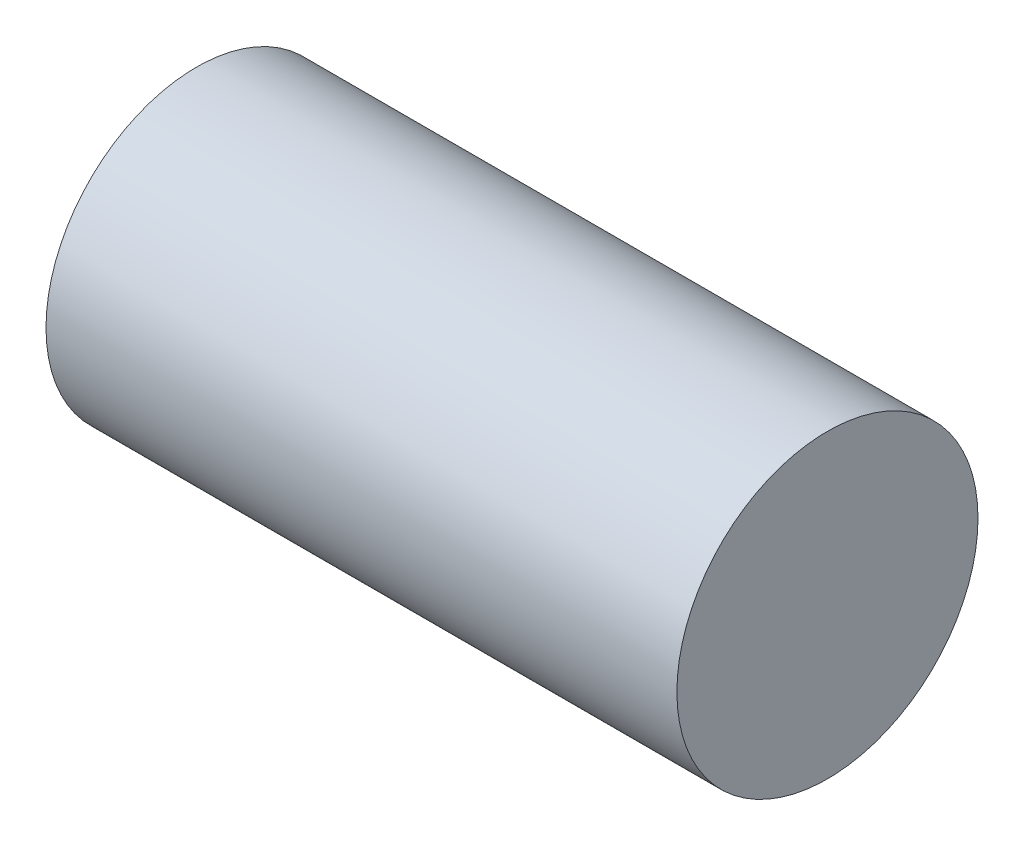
ISO-10303-21;
HEADER;
FILE_DESCRIPTION(('STEP AP214'),'2;1');
FILE_NAME('part.step','',(''),(''),'','','');
FILE_SCHEMA(('AUTOMOTIVE_DESIGN { 1 0 10303 214 1 1 1 1 }'));
ENDSEC;
DATA;
#1=APPLICATION_CONTEXT('core data for automotive mechanical design processes');
#2=APPLICATION_PROTOCOL_DEFINITION('international standard','automotive_design',2000,#1);
#3=PRODUCT_CONTEXT('',#1,'mechanical');
#4=PRODUCT('Part','Part','',(#3));
#5=PRODUCT_RELATED_PRODUCT_CATEGORY('part','',(#4));
#6=PRODUCT_DEFINITION_FORMATION('','',#4);
#7=PRODUCT_DEFINITION_CONTEXT('part definition',#1,'design');
#8=PRODUCT_DEFINITION('design','',#6,#7);
#9=PRODUCT_DEFINITION_SHAPE('','',#8);
#10=(LENGTH_UNIT() NAMED_UNIT(*) SI_UNIT(.MILLI.,.METRE.));
#11=(NAMED_UNIT(*) PLANE_ANGLE_UNIT() SI_UNIT($,.RADIAN.));
#12=(NAMED_UNIT(*) SI_UNIT($,.STERADIAN.) SOLID_ANGLE_UNIT());
#13=UNCERTAINTY_MEASURE_WITH_UNIT(LENGTH_MEASURE(1.E-05),#10,'distance_accuracy_value','');
#14=(GEOMETRIC_REPRESENTATION_CONTEXT(3) GLOBAL_UNCERTAINTY_ASSIGNED_CONTEXT((#13)) GLOBAL_UNIT_ASSIGNED_CONTEXT((#10,
#11,#12)) REPRESENTATION_CONTEXT('',''));
#15=CARTESIAN_POINT('',(0.,0.,0.));
#16=DIRECTION('',(0.,0.,1.));
#17=DIRECTION('',(1.,0.,0.));
#18=AXIS2_PLACEMENT_3D('',#15,#16,#17);
#19=CARTESIAN_POINT('',(27.,33.8375,0.));
#20=DIRECTION('',(1.,0.,0.));
#21=DIRECTION('',(0.,0.,-1.));
#22=AXIS2_PLACEMENT_3D('',#19,#20,#21);
#23=PLANE('',#22);
#24=CARTESIAN_POINT('',(27.,32.525,0.));
#25=DIRECTION('',(-1.,0.,0.));
#26=DIRECTION('',(0.,0.,1.));
#27=AXIS2_PLACEMENT_3D('',#24,#25,#26);
#28=CIRCLE('',#27,2.625);
#29=CARTESIAN_POINT('',(27.,32.525,2.625));
#30=VERTEX_POINT('',#29);
#31=EDGE_CURVE('E18',#30,#30,#28,.T.);
#32=ORIENTED_EDGE('',*,*,#31,.F.);
#33=EDGE_LOOP('',(#32));
#34=FACE_BOUND('',#33,.T.);
#35=ADVANCED_FACE('F14',(#34),#23,.T.);
#36=CARTESIAN_POINT('',(16.,33.8375,0.));
#37=DIRECTION('',(-1.,0.,0.));
#38=DIRECTION('',(0.,0.,1.));
#39=AXIS2_PLACEMENT_3D('',#36,#37,#38);
#40=PLANE('',#39);
#41=CARTESIAN_POINT('',(16.,32.525,0.));
#42=DIRECTION('',(-1.,0.,0.));
#43=DIRECTION('',(0.,0.,1.));
#44=AXIS2_PLACEMENT_3D('',#41,#42,#43);
#45=CIRCLE('',#44,2.625);
#46=CARTESIAN_POINT('',(16.,32.525,2.625));
#47=VERTEX_POINT('',#46);
#48=EDGE_CURVE('E10',#47,#47,#45,.F.);
#49=ORIENTED_EDGE('',*,*,#48,.F.);
#50=EDGE_LOOP('',(#49));
#51=FACE_BOUND('',#50,.T.);
#52=ADVANCED_FACE('F29',(#51),#40,.T.);
#53=CARTESIAN_POINT('',(21.5,32.525,0.));
#54=DIRECTION('',(-1.,0.,0.));
#55=DIRECTION('',(0.,0.,1.));
#56=AXIS2_PLACEMENT_3D('',#53,#54,#55);
#57=CYLINDRICAL_SURFACE('',#56,2.625);
#58=ORIENTED_EDGE('',*,*,#31,.T.);
#59=EDGE_LOOP('',(#58));
#60=FACE_BOUND('',#59,.T.);
#61=ORIENTED_EDGE('',*,*,#48,.T.);
#62=EDGE_LOOP('',(#61));
#63=FACE_BOUND('',#62,.T.);
#64=ADVANCED_FACE('F16',(#60,#63),#57,.T.);
#65=CLOSED_SHELL('',(#35,#52,#64));
#66=MANIFOLD_SOLID_BREP('B1',#65);
#67=ADVANCED_BREP_SHAPE_REPRESENTATION('',(#18,#66),#14);
#68=SHAPE_DEFINITION_REPRESENTATION(#9,#67);
ENDSEC;
END-ISO-10303-21;
